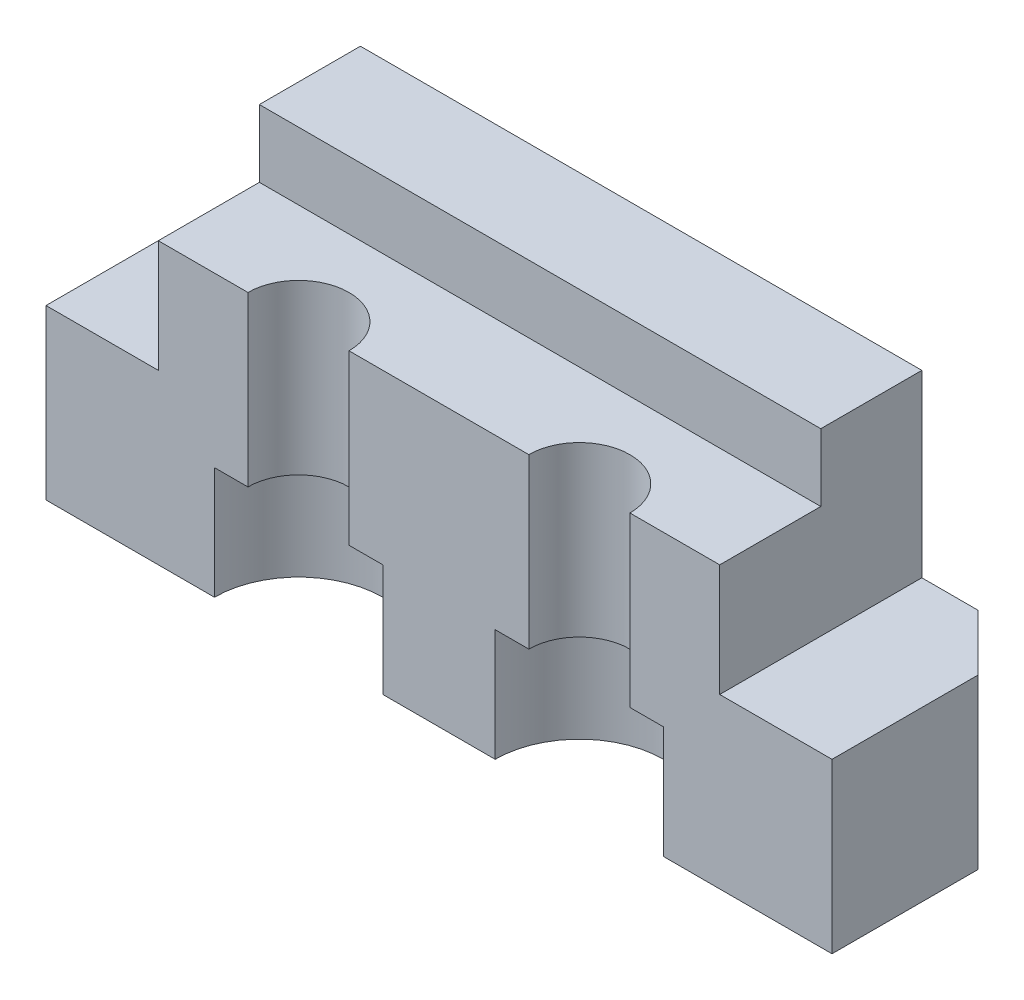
from build123d import *

# Parameters (mm, degrees)
BASE_EXTRUSION_DEPTH    = 36
ESQUISSE2_R             = 7.5
ENL_V_MAT_EXTRU_1_DEPTH = 10
ENL_V_START             = -21
ESQUISSE3_R             = 4.5
ENL_V_MAT_EXTRU_5_DEPTH = 21
ESQUISSE4_W             = 18
ESQUISSE4_H             = 7.016444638
ENL_V_MAT_EXTRU_6_DEPTH = 77.531039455
CHANFREIN1_SIZE         = 5
ENL_V_MAT_EXTRU_7_REACH = 80.645
ESQUISSE5_W             = 73.979107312
ESQUISSE5_H             = 34.662867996


with BuildPart() as part:
    # Esquisse1 → Base-Extrusion (new body)
    with BuildSketch(Plane.XY):
        Polygon((0, 0), (0, 15), (10, 15), (10, 31), (60, 31), (60, 15), (70, 15), (70, 0), align=None)
    extrude(amount=-BASE_EXTRUSION_DEPTH)

    # Esquisse2 → Enl_v. mat.-Extru.1 (cut)
    with BuildSketch(Plane.XZ):
        with Locations((22.5, -18)):
            Circle(ESQUISSE2_R)
        with Locations((47.5, -18)):
            Circle(ESQUISSE2_R)
    extrude(amount=-ENL_V_MAT_EXTRU_1_DEPTH, mode=Mode.SUBTRACT)

    # Esquisse3 → Enl_v. mat.-Extru.5 (cut)
    with BuildSketch(Plane.XZ.offset(-10).offset(ENL_V_START)):
        with Locations((22.48458693, -18)):
            Circle(ESQUISSE3_R)
        with Locations((47.5, -18)):
            Circle(ESQUISSE3_R)
    extrude(amount=ENL_V_MAT_EXTRU_5_DEPTH, mode=Mode.SUBTRACT)

    # Esquisse4 → Enl_v. mat.-Extru.6 (cut, through all)
    with BuildSketch(Plane(origin=(60, 0, 0), x_dir=(0, 0, -1), z_dir=(1, 0, 0))):
        with Locations((18, 28.508222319)):
            Rectangle(ESQUISSE4_W, ESQUISSE4_H)
    extrude(amount=-ENL_V_MAT_EXTRU_6_DEPTH, mode=Mode.SUBTRACT)

    # Chanfrein1
    chanfrein1_edges = [part.edges().sort_by_distance(p)[0] for p in [
        (0, 7.5, -36),
        (70, 7.5, -36),
        (70, 7.5, 0),
        (0, 7.5, 0),
    ]]
    chamfer(chanfrein1_edges, length=CHANFREIN1_SIZE)

    # Esquisse5 → Enl_v. mat.-Extru.7 (cut, up to next)
    with BuildSketch(Plane.XY.offset(-18), mode=Mode.PRIVATE) as enl_v_mat_extru_7_sk1:
        with Locations((34.43019943, 15.594966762)):
            Rectangle(ESQUISSE5_W, ESQUISSE5_H)
    enl_v_mat_extru_7_tool1 = extrude(enl_v_mat_extru_7_sk1.sketch, amount=ENL_V_MAT_EXTRU_7_REACH, mode=Mode.PRIVATE) & part.part
    add(enl_v_mat_extru_7_tool1.solids().sort_by_distance((34.430199, 15.594967, -18))[0], mode=Mode.SUBTRACT)


solid = part.part
